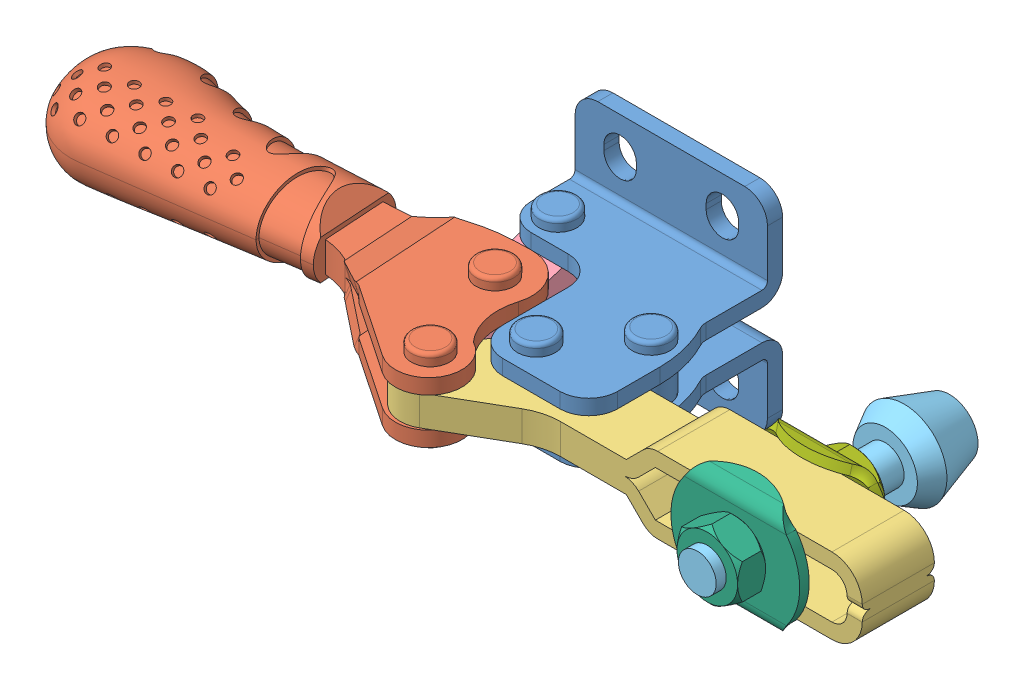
SolidWorks assembly ST-H213U-S.sldasm, configuration Default (file format 15000). Lengths in mm.
Overall size (112.68 28 39.67).
7 component instances, 7 part files, 0 mates.
Components (placement in the parent):
- ST-H213U-S_01-1: ST-H213U-S_01.SLDPRT [ﾃﾞﾌｫﾙﾄ] at (0 9.5 0) size (27.43 28 27.62)
- ST-H213U-S_02-1: ST-H213U-S_02.SLDPRT [ﾃﾞﾌｫﾙﾄ] at (4.5666 9.5 31.5987) x (0.997902 0 -0.064747) z (0.064747 0 0.997902) size (61.1 11.79 26.9)
- ST-H213U-S_03-1: ST-H213U-S_03.SLDPRT [ﾃﾞﾌｫﾙﾄ] at (4.5666 9.5 31.5987) size (58.41 10.02 16.1)
- ST-H213U-S_04-1: ST-H213U-S_04.SLDPRT [ﾃﾞﾌｫﾙﾄ] at (0.1498 9.5 18.6577) x (-0.228291 0 -0.973593) z (0.973593 0 -0.228291) size (17.49 4 6.35)
- ST-H213U-S_05-1: ST-H213U-S_05.SLDPRT [ﾃﾞﾌｫﾙﾄ] at (43.4823 9.5 2) size (11.3 11.3 33.3)
- ST-H213U-S_06-1: ST-H213U-S_06.SLDPRT [ﾃﾞﾌｫﾙﾄ] at (43.4823 9.5 29.0274) size (17 14.99 6.99)
- ST-H213U-S_07-1: ST-H213U-S_07.SLDPRT [ﾃﾞﾌｫﾙﾄ] at (43.4823 9.5 19.5024) x (-1 0 0) z (0 0 -1) size (17 14.99 6.99)
